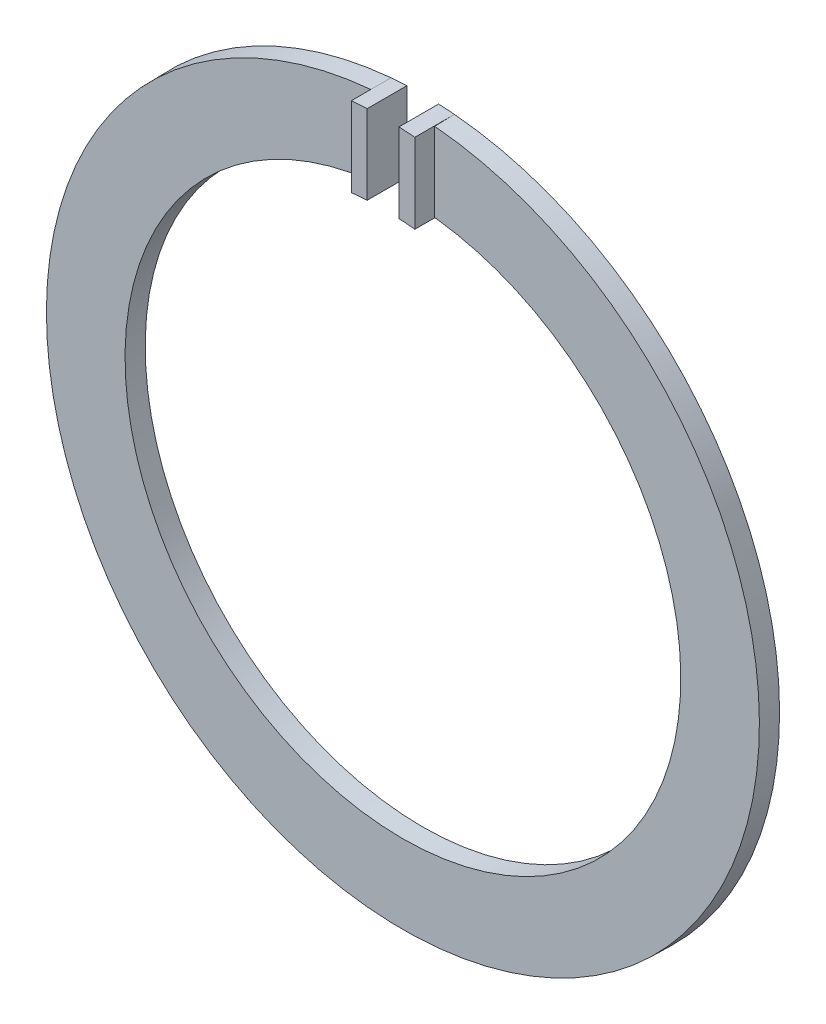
from build123d import *

# Parameters (mm, degrees)
SKETCH1_R           = 57.15
SKETCH1_R_2         = 44.45
BOSS_EXTRUDE1_DEPTH = 3.175
BOSS_EXTRUDE1_DRAFT = 1
SKETCH2_W           = 5.08
SKETCH2_H           = 19.548027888
CUT_EXTRUDE1_DEPTH  = 3.175
BOSS_EXTRUDE2_DEPTH = 6.35


with BuildPart() as part:
    # Sketch1 → Boss-Extrude1 (with draft: the straight prism first)
    with BuildSketch(Plane.XY):
        Circle(SKETCH1_R)
        Circle(SKETCH1_R_2, mode=Mode.SUBTRACT)
    extrude(amount=BOSS_EXTRUDE1_DEPTH)
    # Boss-Extrude1: the draft: its side faces are tilted about the plane it starts from
    boss_extrude1_sides = [part.faces().sort_by_distance(p)[0] for p in [
        (-57.15, 0, 1.5875),
        (-44.45, 0, 1.5875),
    ]]
    draft(boss_extrude1_sides, Plane.XY, BOSS_EXTRUDE1_DRAFT)

    # Sketch2 → Cut-Extrude1 (cut)
    with BuildSketch(Plane.XY.offset(3.175)):
        with Locations((0, 50.5113156)):
            Rectangle(SKETCH2_W, SKETCH2_H)
    extrude(amount=-CUT_EXTRUDE1_DEPTH, mode=Mode.SUBTRACT)

    # Sketch3 → Boss-Extrude2 (add)
    with BuildSketch(Plane(origin=(0, 0, 0), x_dir=(-1, 0, 0), z_dir=(0, 0, -1))):
        with BuildLine():
            Line((-2.54, 57.093527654), (-2.54, 44.377369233))
            ThreePointArc((-2.54, 44.377369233), (-3.811567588, 44.286278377), (-5.08, 44.158760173))
            Line((-5.08, 44.158760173), (-5.08, 56.923774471))
            ThreePointArc((-5.08, 56.923774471), (-3.810945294, 57.022795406), (-2.54, 57.093527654))
        make_face()
        with BuildLine():
            Line((2.54, 44.377369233), (2.54, 57.093527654))
            ThreePointArc((2.54, 57.093527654), (3.810945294, 57.022795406), (5.08, 56.923774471))
            Line((5.08, 56.923774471), (5.08, 44.158760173))
            ThreePointArc((5.08, 44.158760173), (3.811567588, 44.286278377), (2.54, 44.377369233))
        make_face()
    extrude(amount=-BOSS_EXTRUDE2_DEPTH)


solid = part.part
